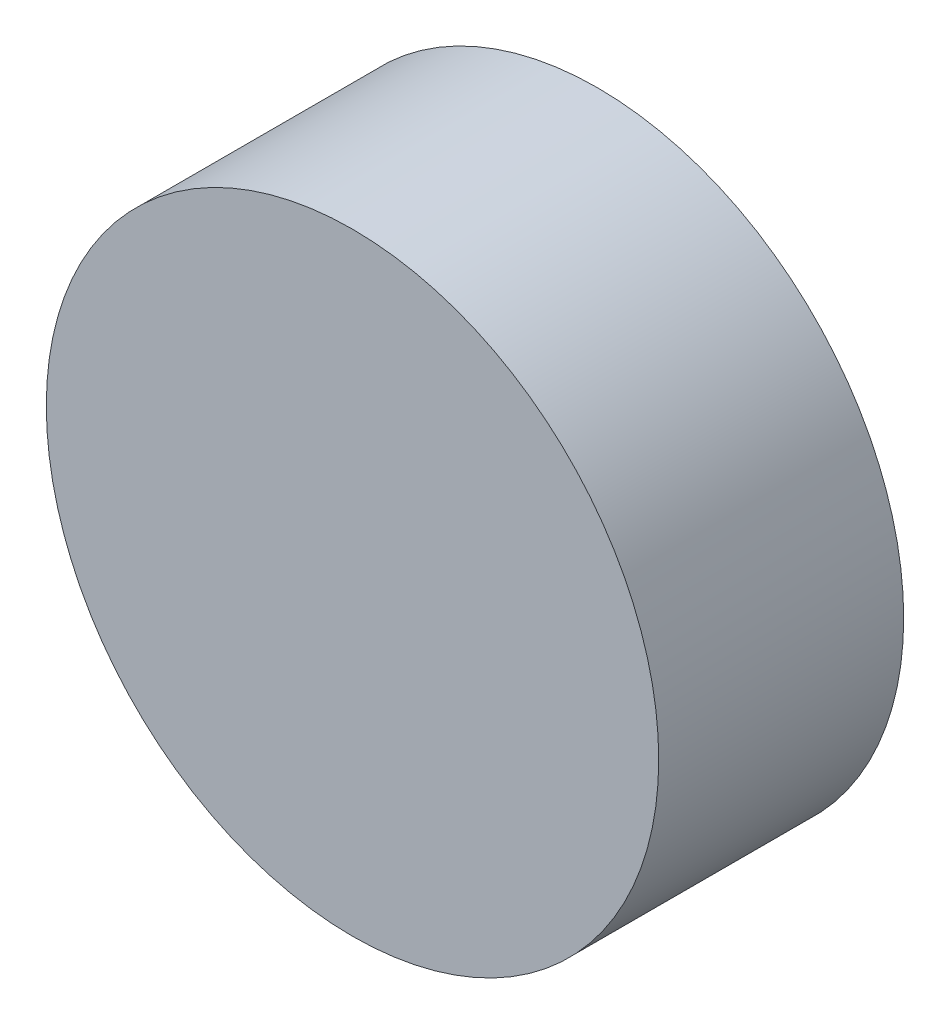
from build123d import *

# Parameters (mm, degrees)
SKETCH_1_R                = 3.75
MOUNTING_SCREW_HEAD_DEPTH = 1.5


with BuildPart() as part:
    # Sketch 1 → Mounting_Screw_Head (new, symmetric)
    with BuildSketch(Plane.XY):
        Circle(SKETCH_1_R)
    extrude(amount=MOUNTING_SCREW_HEAD_DEPTH, both=True)


solid = part.part
